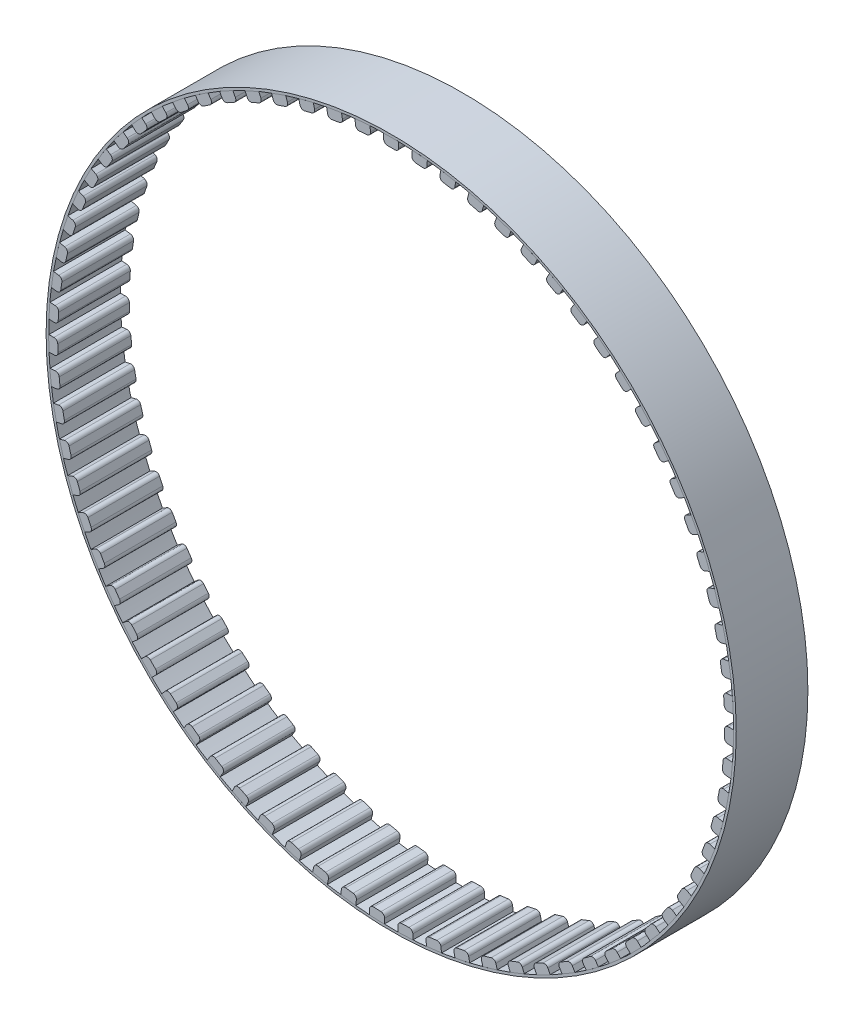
from build123d import *

# Parameters (mm, degrees)
ESQUISSE1_R                  = 45.75
BOSS_EXTRU_1_DEPTH           = 9.5
ESQUISSE2_R                  = 45.41255109
ENL_V_MAT_EXTRU_1_DEPTH      = 9.5
ESQUISSE3_W                  = 2
ESQUISSE3_H                  = 1.2
BOSS_EXTRU_2_DEPTH           = 9.5
CONG_2_R                     = 0.5
R_P_TITION_CIRCULAIRE7_COUNT = 75


with BuildPart() as part:
    # Esquisse1 → Boss.-Extru.1 (new body)
    with BuildSketch(Plane.XY):
        Circle(ESQUISSE1_R)
    extrude(amount=BOSS_EXTRU_1_DEPTH)

    # Esquisse2 → Enl_v. mat.-Extru.1 (cut)
    with BuildSketch(Plane.XY.offset(9.5)):
        Circle(ESQUISSE2_R)
    extrude(amount=-ENL_V_MAT_EXTRU_1_DEPTH, mode=Mode.SUBTRACT)


with BuildPart() as body_2:
    # Esquisse3 → Boss.-Extru.2 (new body)
    with BuildSketch(Plane(origin=(0, 0, 0), x_dir=(-1, 0, 0), z_dir=(0, 0, -1))):
        with Locations((0, 44.801539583)):
            Rectangle(ESQUISSE3_W, ESQUISSE3_H)
    extrude(amount=-BOSS_EXTRU_2_DEPTH)

    # Cong_2
    cong_2_edges = [body_2.edges().sort_by_distance(p)[0] for p in [
        (-1, 44.201539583, 4.75),
        (1, 44.201539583, 4.75),
    ]]
    fillet(cong_2_edges, radius=CONG_2_R)

    # R_p_tition circulaire7: body 2 ×75 about axis
    r_p_tition_circulaire7_axis = Axis((0, 0, 0), (0, 0, 1))


with BuildPart() as body_2_1:
    add(body_2.part)
    for i in range(1, R_P_TITION_CIRCULAIRE7_COUNT):
        add(body_2.part.rotate(r_p_tition_circulaire7_axis, i * 360 / R_P_TITION_CIRCULAIRE7_COUNT))


solid = Compound([part.part, body_2_1.part])
